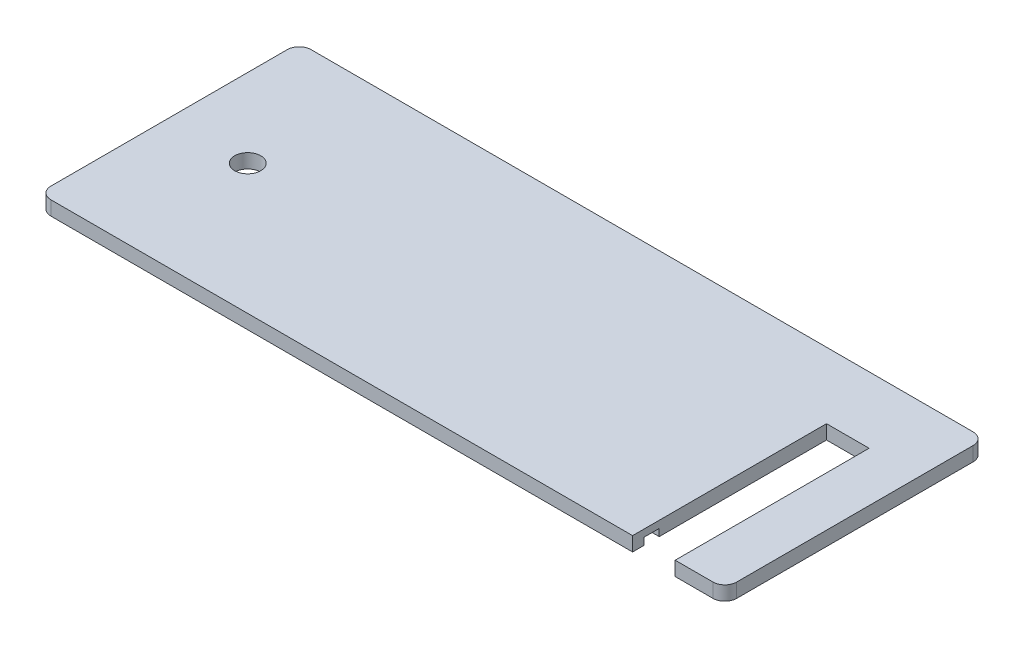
from build123d import *

# Parameters (mm, degrees)
ESQUISSE1_R             = 5.5
BOSS_EXTRU_1_DEPTH      = 6
ESQUISSE2_W             = 267.5
ESQUISSE2_H             = 87.55
ENL_V_MAT_EXTRU_1_DEPTH = 3
ESQUISSE4_R             = 1.1
ENL_V_MAT_EXTRU_2_DEPTH = 1
ESQUISSE5_R             = 6
ENL_V_MAT_EXTRU_3_DEPTH = 3.5


with BuildPart() as part:
    # Esquisse1 → Boss.-Extru.1 (new body)
    with BuildSketch(Plane(origin=(0, 0, 0), x_dir=(1, 0, 0), z_dir=(0, 1, 0))):
        with BuildLine():
            Line((269, 0), (285, 0))
            ThreePointArc((285, 0), (288.535533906, 1.464466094), (290, 5))
            Line((290, 5), (290, 105))
            ThreePointArc((290, 105), (288.535533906, 108.535533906), (285, 110))
            Line((285, 110), (5, 110))
            ThreePointArc((5, 110), (1.464466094, 108.535533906), (0, 105))
            Line((0, 105), (0, 5))
            ThreePointArc((0, 5), (1.464466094, 1.464466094), (5, 0))
            Line((5, 0), (251, 0))
            Line((251, 0), (251, 82))
            Line((251, 82), (269, 82))
            Line((269, 82), (269, 0))
        make_face()
        with Locations(Location((33.25, 55, 0), (0, 0, 270))):
            Circle(ESQUISSE1_R, mode=Mode.SUBTRACT)
    extrude(amount=BOSS_EXTRU_1_DEPTH)

    # Esquisse2 → Enl_v. mat.-Extru.1 (cut)
    with BuildSketch(Plane.XZ):
        with BuildLine():
            Line((4.75, -102.9872583), (4.75, -7.0127417))
            ThreePointArc((4.75, -7.0127417), (4.75, -4.75), (7.0127417, -4.75))
            Line((7.0127417, -4.75), (282.9872583, -4.75))
            ThreePointArc((282.9872583, -4.75), (285.25, -4.75), (285.25, -7.0127417))
            Line((285.25, -7.0127417), (285.25, -102.9872583))
            ThreePointArc((285.25, -102.9872583), (285.25, -105.25), (282.9872583, -105.25))
            Line((282.9872583, -105.25), (281.0127417, -105.25))
            ThreePointArc((281.0127417, -105.25), (278.75, -105.25), (278.75, -102.9872583))
            Line((278.75, -102.9872583), (278.75, -102))
            Line((278.75, -102), (11.25, -102))
            Line((11.25, -102), (11.25, -102.9872583))
            ThreePointArc((11.25, -102.9872583), (11.25, -105.25), (8.9872583, -105.25))
            Line((8.9872583, -105.25), (7.0127417, -105.25))
            ThreePointArc((7.0127417, -105.25), (4.75, -105.25), (4.75, -102.9872583))
        make_face()
        with Locations((145, -55.025)):
            Rectangle(ESQUISSE2_W, ESQUISSE2_H, mode=Mode.SUBTRACT)
    extrude(amount=-ENL_V_MAT_EXTRU_1_DEPTH, mode=Mode.SUBTRACT)

    # Esquisse4 → Enl_v. mat.-Extru.2 (cut)
    with BuildSketch(Plane.XZ):
        with Locations(Location((41.25, -44, 0), (0, 0, 270))):
            Circle(ESQUISSE4_R)
        with Locations(Location((87.25, -44, 0), (0, 0, 270))):
            Circle(ESQUISSE4_R)
        with Locations(Location((87.25, -66, 0), (0, 0, 90))):
            Circle(ESQUISSE4_R)
        with Locations(Location((41.25, -66, 0), (0, 0, 90))):
            Circle(ESQUISSE4_R)
    extrude(amount=-ENL_V_MAT_EXTRU_2_DEPTH, mode=Mode.SUBTRACT)

    # Esquisse5 → Enl_v. mat.-Extru.3 (cut)
    with BuildSketch(Plane.XZ):
        with Locations(Location((235, -7.75, 0), (0, 0, 270))):
            Circle(ESQUISSE5_R)
        with Locations(Location((8.25, -55, 0), (0, 0, 270))):
            Circle(ESQUISSE5_R)
    extrude(amount=-ENL_V_MAT_EXTRU_3_DEPTH, mode=Mode.SUBTRACT)


solid = part.part
